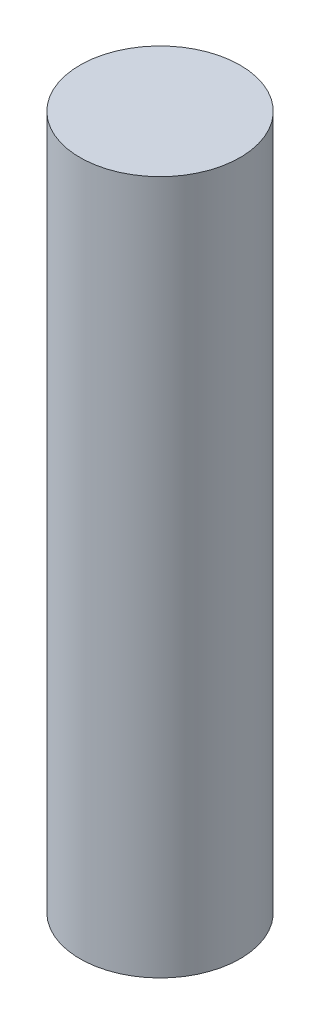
from build123d import *

# Parameters (mm, degrees)
SKETCH1_R           = 3
BOSS_EXTRUDE1_DEPTH = 26


with BuildPart() as part:
    # Sketch1 → Boss-Extrude1 (new body)
    with BuildSketch(Plane(origin=(0, 0, 0), x_dir=(1, 0, 0), z_dir=(0, 1, 0))):
        with Locations(Location((-16897.058823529, 3176.470588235, 0), (0, 0, 90))):
            Circle(SKETCH1_R)
    extrude(amount=BOSS_EXTRUDE1_DEPTH)


solid = part.part
